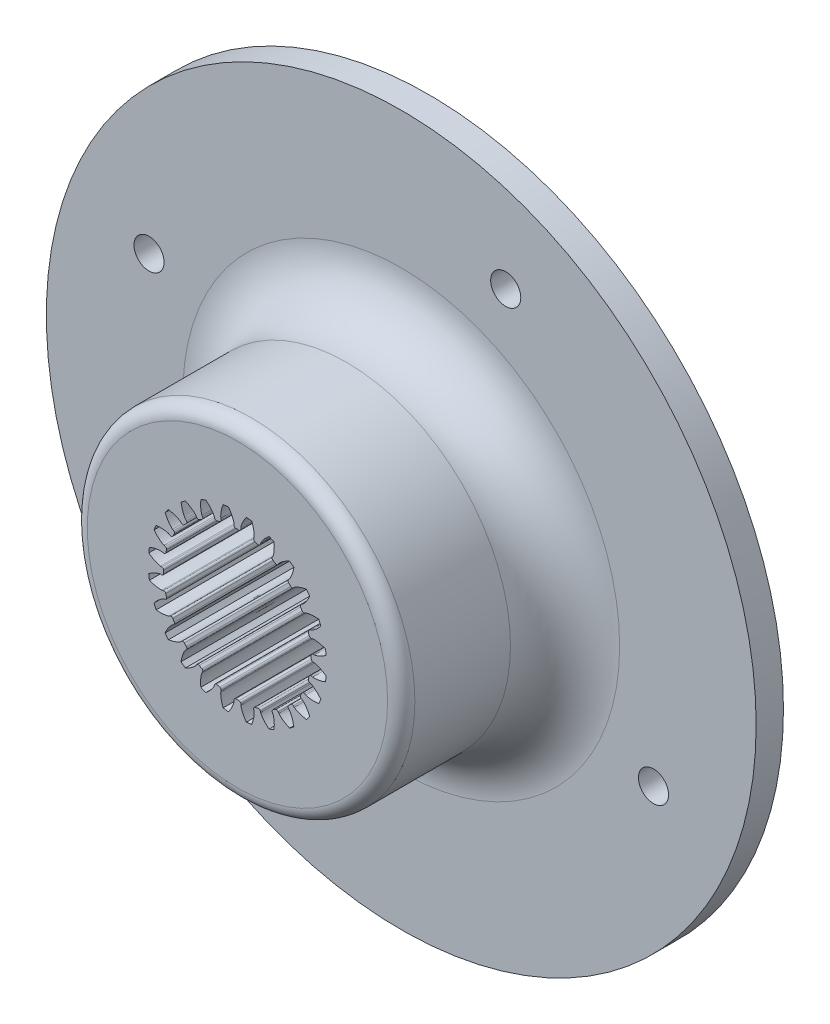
from build123d import *

# Parameters (mm, degrees)
SKETCH1_R           = 82.55
SKETCH1_R_2         = 3.5
SKETCH1_R_3         = 30
BOSS_EXTRUDE1_DEPTH = 6.35
SKETCH2_R           = 38.1
BOSS_EXTRUDE2_DEPTH = 38.1
FILLET1_R           = 12.7
FILLET2_R           = 3.175


with BuildPart() as part:
    # Sketch1 → Boss-Extrude1 (new body)
    # profile 1 of 2: a face of its own
    with BuildSketch(Plane.XY):
        with Locations((300, 306.787824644)):
            Circle(SKETCH1_R)
        with Locations((241.333649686, 331.088222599)):
            Circle(SKETCH1_R_2, mode=Mode.SUBTRACT)
        with Locations((324.300397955, 365.454174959)):
            Circle(SKETCH1_R_2, mode=Mode.SUBTRACT)
        with Locations((358.666350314, 282.487426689)):
            Circle(SKETCH1_R_2, mode=Mode.SUBTRACT)
        with Locations((275.699602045, 248.12147433)):
            Circle(SKETCH1_R_2, mode=Mode.SUBTRACT)
        with Locations((300, 306.787824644)):
            Circle(SKETCH1_R_3, mode=Mode.SUBTRACT)
    # profile 2 of 2: a face of its own
    with BuildSketch(Plane.XY):
        with Locations((300, 306.787824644)):
            Circle(SKETCH1_R_3)
    extrude(amount=BOSS_EXTRUDE1_DEPTH)

    # Sketch2 → Boss-Extrude2 (add)
    with BuildSketch(Plane.XY.offset(6.35)):
        with Locations(Location((300, 306.787824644, 0), (0, 0, 180))):
            Circle(SKETCH2_R)
        with BuildLine():
            Line((284.914350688, 316.426594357), (285.175965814, 316.257373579))
            ThreePointArc((285.175965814, 316.257373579), (285.362581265, 315.991230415), (285.311198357, 315.670267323))
            ThreePointArc((285.311198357, 315.670267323), (285.134132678, 315.370637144), (284.963178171, 315.067478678))
            ThreePointArc((284.963178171, 315.067478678), (284.710907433, 314.862498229), (284.387112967, 314.891040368))
            Line((284.387112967, 314.891040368), (284.109755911, 315.032995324))
            add(Edge.make_bspline(
                [(284.109755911, 315.032995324), (283.877385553, 315.148388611), (283.357209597, 315.262313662), (282.60596157, 315.35436869), (281.840682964, 315.363024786), (281.340658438, 315.326080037), (281.090403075, 315.300817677)],
                knots=[-0.000187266, -0.000187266, -0.000187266, -0.000187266, 0.232040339, 0.464267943, 0.696495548, 0.928723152, 0.928723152, 0.928723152, 0.928723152], degree=3))
            ThreePointArc((281.090403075, 315.300817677), (280.841048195, 314.723722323), (280.609300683, 314.139333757))
            add(Edge.make_bspline(
                [(280.609300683, 314.139333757), (280.768394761, 313.944513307), (281.095841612, 313.564818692), (281.643096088, 313.029805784), (282.239401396, 312.563685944), (282.687778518, 312.276423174), (282.93368455, 312.193707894)],
                knots=[-0.019632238, -0.019632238, -0.019632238, -0.019632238, 0.212595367, 0.444822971, 0.677050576, 0.90927818, 0.90927818, 0.90927818, 0.90927818], degree=3))
            Line((282.93368455, 312.193707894), (283.230182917, 312.097964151))
            ThreePointArc((283.230182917, 312.097964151), (283.47932252, 311.889189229), (283.512761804, 311.565863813))
            ThreePointArc((283.512761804, 311.565863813), (283.419279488, 311.230615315), (283.332613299, 310.893540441))
            ThreePointArc((283.332613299, 310.893540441), (283.141991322, 310.63025206), (282.821842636, 310.574017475))
            Line((282.821842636, 310.574017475), (282.517195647, 310.639350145))
            add(Edge.make_bspline(
                [(282.517195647, 310.639350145), (282.262877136, 310.690669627), (281.730939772, 310.666081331), (280.981464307, 310.560562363), (280.240021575, 310.370854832), (279.766596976, 310.205753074), (279.531407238, 310.116580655)],
                knots=[-0.000187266, -0.000187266, -0.000187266, -0.000187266, 0.232040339, 0.464267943, 0.696495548, 0.928723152, 0.928723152, 0.928723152, 0.928723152], degree=3))
            ThreePointArc((279.531407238, 310.116580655), (279.439912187, 309.494611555), (279.367312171, 308.870154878))
            add(Edge.make_bspline(
                [(279.367312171, 308.870154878), (279.571408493, 308.723149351), (279.985970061, 308.441141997), (280.653048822, 308.065999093), (281.349676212, 307.770097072), (281.85712433, 307.608671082), (282.116059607, 307.592419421)],
                knots=[-0.019632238, -0.019632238, -0.019632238, -0.019632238, 0.212595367, 0.444822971, 0.677050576, 0.90927818, 0.90927818, 0.90927818, 0.90927818], degree=3))
            Line((282.116059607, 307.592419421), (282.427235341, 307.576677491))
            ThreePointArc((282.427235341, 307.576677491), (282.721920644, 307.439498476), (282.837903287, 307.13584483))
            ThreePointArc((282.837903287, 307.13584483), (282.834375, 306.787824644), (282.837903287, 306.439804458))
            ThreePointArc((282.837903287, 306.439804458), (282.721920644, 306.136150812), (282.427235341, 305.998971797))
            Line((282.427235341, 305.998971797), (282.116059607, 305.983229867))
            add(Edge.make_bspline(
                [(282.116059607, 305.983229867), (281.85712433, 305.966978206), (281.349676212, 305.805552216), (280.653048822, 305.509650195), (279.985970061, 305.134507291), (279.571408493, 304.852499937), (279.367312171, 304.705494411)],
                knots=[-0.000187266, -0.000187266, -0.000187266, -0.000187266, 0.232040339, 0.464267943, 0.696495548, 0.928723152, 0.928723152, 0.928723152, 0.928723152], degree=3))
            ThreePointArc((279.367312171, 304.705494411), (279.439912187, 304.081037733), (279.531407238, 303.459068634))
            add(Edge.make_bspline(
                [(279.531407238, 303.459068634), (279.766596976, 303.369896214), (280.240021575, 303.204794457), (280.981464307, 303.015086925), (281.730939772, 302.909567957), (282.262877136, 302.884979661), (282.517195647, 302.936299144)],
                knots=[-0.019632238, -0.019632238, -0.019632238, -0.019632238, 0.212595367, 0.444822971, 0.677050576, 0.90927818, 0.90927818, 0.90927818, 0.90927818], degree=3))
            Line((282.517195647, 302.936299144), (282.821842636, 303.001631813))
            ThreePointArc((282.821842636, 303.001631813), (283.141991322, 302.945397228), (283.332613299, 302.682108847))
            ThreePointArc((283.332613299, 302.682108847), (283.419279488, 302.345033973), (283.512761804, 302.009785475))
            ThreePointArc((283.512761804, 302.009785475), (283.47932252, 301.68646006), (283.230182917, 301.477685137))
            Line((283.230182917, 301.477685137), (282.93368455, 301.381941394))
            add(Edge.make_bspline(
                [(282.93368455, 301.381941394), (282.687778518, 301.299226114), (282.239401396, 301.011963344), (281.643096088, 300.545843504), (281.095841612, 300.010830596), (280.768394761, 299.631135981), (280.609300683, 299.436315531)],
                knots=[-0.000187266, -0.000187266, -0.000187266, -0.000187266, 0.232040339, 0.464267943, 0.696495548, 0.928723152, 0.928723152, 0.928723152, 0.928723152], degree=3))
            ThreePointArc((280.609300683, 299.436315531), (280.841048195, 298.851926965), (281.090403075, 298.274831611))
            add(Edge.make_bspline(
                [(281.090403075, 298.274831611), (281.340658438, 298.249569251), (281.840682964, 298.212624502), (282.60596157, 298.221280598), (283.357209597, 298.313335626), (283.877385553, 298.427260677), (284.109755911, 298.542653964)],
                knots=[-0.019632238, -0.019632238, -0.019632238, -0.019632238, 0.212595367, 0.444822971, 0.677050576, 0.90927818, 0.90927818, 0.90927818, 0.90927818], degree=3))
            Line((284.109755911, 298.542653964), (284.387112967, 298.68460892))
            ThreePointArc((284.387112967, 298.68460892), (284.710907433, 298.713151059), (284.963178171, 298.50817061))
            ThreePointArc((284.963178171, 298.50817061), (285.134132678, 298.205012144), (285.311198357, 297.905381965))
            ThreePointArc((285.311198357, 297.905381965), (285.362581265, 297.584418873), (285.175965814, 297.318275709))
            Line((285.175965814, 297.318275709), (284.914350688, 297.149054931))
            add(Edge.make_bspline(
                [(284.914350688, 297.149054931), (284.698231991, 297.005512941), (284.339482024, 296.611989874), (283.884136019, 296.007417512), (283.494000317, 295.348994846), (283.275983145, 294.89748853), (283.172733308, 294.668129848)],
                knots=[-0.000187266, -0.000187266, -0.000187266, -0.000187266, 0.232040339, 0.464267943, 0.696495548, 0.928723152, 0.928723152, 0.928723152, 0.928723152], degree=3))
            ThreePointArc((283.172733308, 294.668129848), (283.547835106, 294.16363451), (283.938056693, 293.670740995))
            add(Edge.make_bspline(
                [(283.938056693, 293.670740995), (284.186323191, 293.711110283), (284.678871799, 293.804840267), (285.415833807, 294.011270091), (286.117658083, 294.294625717), (286.590623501, 294.53930031), (286.785210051, 294.710903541)],
                knots=[-0.019632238, -0.019632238, -0.019632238, -0.019632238, 0.212595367, 0.444822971, 0.677050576, 0.90927818, 0.90927818, 0.90927818, 0.90927818], degree=3))
            Line((286.785210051, 294.710903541), (287.016375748, 294.919806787))
            ThreePointArc((287.016375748, 294.919806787), (287.321749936, 295.031180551), (287.618477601, 294.898477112))
            ThreePointArc((287.618477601, 294.898477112), (287.862070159, 294.649894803), (288.110652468, 294.406302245))
            ThreePointArc((288.110652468, 294.406302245), (288.243355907, 294.10957458), (288.131982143, 293.804200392))
            Line((288.131982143, 293.804200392), (287.923078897, 293.573034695))
            add(Edge.make_bspline(
                [(287.923078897, 293.573034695), (287.751475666, 293.378448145), (287.506801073, 292.905482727), (287.223445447, 292.203658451), (287.017015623, 291.466696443), (286.923285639, 290.974147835), (286.882916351, 290.725881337)],
                knots=[-0.000187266, -0.000187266, -0.000187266, -0.000187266, 0.232040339, 0.464267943, 0.696495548, 0.928723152, 0.928723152, 0.928723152, 0.928723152], degree=3))
            ThreePointArc((286.882916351, 290.725881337), (287.375809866, 290.33565975), (287.880305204, 289.960557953))
            add(Edge.make_bspline(
                [(287.880305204, 289.960557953), (288.109663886, 290.063807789), (288.561170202, 290.281824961), (289.219592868, 290.671960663), (289.82416523, 291.127306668), (290.217688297, 291.486056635), (290.361230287, 291.702175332)],
                knots=[-0.019632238, -0.019632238, -0.019632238, -0.019632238, 0.212595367, 0.444822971, 0.677050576, 0.90927818, 0.90927818, 0.90927818, 0.90927818], degree=3))
            Line((290.361230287, 291.702175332), (290.530451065, 291.963790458))
            ThreePointArc((290.530451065, 291.963790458), (290.796594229, 292.150405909), (291.117557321, 292.099023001))
            ThreePointArc((291.117557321, 292.099023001), (291.4171875, 291.921957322), (291.720345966, 291.751002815))
            ThreePointArc((291.720345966, 291.751002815), (291.925326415, 291.498732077), (291.896784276, 291.174937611))
            Line((291.896784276, 291.174937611), (291.75482932, 290.897580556))
            add(Edge.make_bspline(
                [(291.75482932, 290.897580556), (291.639436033, 290.665210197), (291.525510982, 290.145034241), (291.433455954, 289.393786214), (291.424799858, 288.628507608), (291.461744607, 288.128483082), (291.487006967, 287.878227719)],
                knots=[-0.000187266, -0.000187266, -0.000187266, -0.000187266, 0.232040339, 0.464267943, 0.696495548, 0.928723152, 0.928723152, 0.928723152, 0.928723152], degree=3))
            ThreePointArc((291.487006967, 287.878227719), (292.064102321, 287.628872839), (292.648490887, 287.397125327))
            add(Edge.make_bspline(
                [(292.648490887, 287.397125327), (292.843311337, 287.556219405), (293.223005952, 287.883666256), (293.75801886, 288.430920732), (294.2241387, 289.02722604), (294.51140147, 289.475603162), (294.59411675, 289.721509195)],
                knots=[-0.019632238, -0.019632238, -0.019632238, -0.019632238, 0.212595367, 0.444822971, 0.677050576, 0.90927818, 0.90927818, 0.90927818, 0.90927818], degree=3))
            Line((294.59411675, 289.721509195), (294.689860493, 290.018007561))
            ThreePointArc((294.689860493, 290.018007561), (294.898635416, 290.267147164), (295.221960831, 290.300586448))
            ThreePointArc((295.221960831, 290.300586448), (295.557209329, 290.207104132), (295.894284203, 290.120437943))
            ThreePointArc((295.894284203, 290.120437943), (296.157572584, 289.929815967), (296.213807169, 289.60966728))
            Line((296.213807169, 289.60966728), (296.148474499, 289.305020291))
            add(Edge.make_bspline(
                [(296.148474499, 289.305020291), (296.097155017, 289.05070178), (296.121743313, 288.518764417), (296.227262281, 287.769288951), (296.416969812, 287.027846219), (296.58207157, 286.55442162), (296.67124399, 286.319231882)],
                knots=[-0.000187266, -0.000187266, -0.000187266, -0.000187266, 0.232040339, 0.464267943, 0.696495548, 0.928723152, 0.928723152, 0.928723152, 0.928723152], degree=3))
            ThreePointArc((296.67124399, 286.319231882), (297.293213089, 286.227736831), (297.917669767, 286.155136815))
            add(Edge.make_bspline(
                [(297.917669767, 286.155136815), (298.064675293, 286.359233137), (298.346682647, 286.773794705), (298.721825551, 287.440873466), (299.017727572, 288.137500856), (299.179153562, 288.644948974), (299.195405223, 288.903884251)],
                knots=[-0.019632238, -0.019632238, -0.019632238, -0.019632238, 0.212595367, 0.444822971, 0.677050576, 0.90927818, 0.90927818, 0.90927818, 0.90927818], degree=3))
            Line((299.195405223, 288.903884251), (299.211147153, 289.215059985))
            ThreePointArc((299.211147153, 289.215059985), (299.348326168, 289.509745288), (299.651979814, 289.625727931))
            ThreePointArc((299.651979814, 289.625727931), (300, 289.622199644), (300.348020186, 289.625727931))
            ThreePointArc((300.348020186, 289.625727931), (300.651673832, 289.509745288), (300.788852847, 289.215059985))
            Line((300.788852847, 289.215059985), (300.804594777, 288.903884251))
            add(Edge.make_bspline(
                [(300.804594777, 288.903884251), (300.820846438, 288.644948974), (300.982272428, 288.137500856), (301.278174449, 287.440873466), (301.653317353, 286.773794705), (301.935324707, 286.359233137), (302.082330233, 286.155136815)],
                knots=[-0.000187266, -0.000187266, -0.000187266, -0.000187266, 0.232040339, 0.464267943, 0.696495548, 0.928723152, 0.928723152, 0.928723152, 0.928723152], degree=3))
            ThreePointArc((302.082330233, 286.155136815), (302.706786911, 286.227736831), (303.32875601, 286.319231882))
            add(Edge.make_bspline(
                [(303.32875601, 286.319231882), (303.41792843, 286.55442162), (303.583030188, 287.027846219), (303.772737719, 287.769288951), (303.878256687, 288.518764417), (303.902844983, 289.05070178), (303.851525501, 289.305020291)],
                knots=[-0.019632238, -0.019632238, -0.019632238, -0.019632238, 0.212595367, 0.444822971, 0.677050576, 0.90927818, 0.90927818, 0.90927818, 0.90927818], degree=3))
            Line((303.851525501, 289.305020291), (303.786192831, 289.60966728))
            ThreePointArc((303.786192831, 289.60966728), (303.842427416, 289.929815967), (304.105715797, 290.120437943))
            ThreePointArc((304.105715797, 290.120437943), (304.442790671, 290.207104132), (304.778039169, 290.300586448))
            ThreePointArc((304.778039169, 290.300586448), (305.101364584, 290.267147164), (305.310139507, 290.018007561))
            Line((305.310139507, 290.018007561), (305.40588325, 289.721509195))
            add(Edge.make_bspline(
                [(305.40588325, 289.721509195), (305.48859853, 289.475603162), (305.7758613, 289.02722604), (306.24198114, 288.430920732), (306.776994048, 287.883666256), (307.156688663, 287.556219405), (307.351509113, 287.397125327)],
                knots=[-0.000187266, -0.000187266, -0.000187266, -0.000187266, 0.232040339, 0.464267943, 0.696495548, 0.928723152, 0.928723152, 0.928723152, 0.928723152], degree=3))
            ThreePointArc((307.351509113, 287.397125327), (307.935897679, 287.628872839), (308.512993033, 287.878227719))
            add(Edge.make_bspline(
                [(308.512993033, 287.878227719), (308.538255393, 288.128483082), (308.575200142, 288.628507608), (308.566544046, 289.393786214), (308.474489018, 290.145034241), (308.360563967, 290.665210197), (308.24517068, 290.897580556)],
                knots=[-0.019632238, -0.019632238, -0.019632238, -0.019632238, 0.212595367, 0.444822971, 0.677050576, 0.90927818, 0.90927818, 0.90927818, 0.90927818], degree=3))
            Line((308.24517068, 290.897580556), (308.103215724, 291.174937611))
            ThreePointArc((308.103215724, 291.174937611), (308.074673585, 291.498732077), (308.279654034, 291.751002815))
            ThreePointArc((308.279654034, 291.751002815), (308.5828125, 291.921957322), (308.882442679, 292.099023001))
            ThreePointArc((308.882442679, 292.099023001), (309.203405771, 292.150405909), (309.469548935, 291.963790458))
            Line((309.469548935, 291.963790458), (309.638769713, 291.702175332))
            add(Edge.make_bspline(
                [(309.638769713, 291.702175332), (309.782311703, 291.486056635), (310.17583477, 291.127306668), (310.780407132, 290.671960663), (311.438829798, 290.281824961), (311.890336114, 290.063807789), (312.119694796, 289.960557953)],
                knots=[-0.000187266, -0.000187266, -0.000187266, -0.000187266, 0.232040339, 0.464267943, 0.696495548, 0.928723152, 0.928723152, 0.928723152, 0.928723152], degree=3))
            ThreePointArc((312.119694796, 289.960557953), (312.624190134, 290.33565975), (313.117083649, 290.725881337))
            add(Edge.make_bspline(
                [(313.117083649, 290.725881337), (313.076714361, 290.974147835), (312.982984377, 291.466696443), (312.776554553, 292.203658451), (312.493198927, 292.905482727), (312.248524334, 293.378448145), (312.076921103, 293.573034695)],
                knots=[-0.019632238, -0.019632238, -0.019632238, -0.019632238, 0.212595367, 0.444822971, 0.677050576, 0.90927818, 0.90927818, 0.90927818, 0.90927818], degree=3))
            Line((312.076921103, 293.573034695), (311.868017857, 293.804200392))
            ThreePointArc((311.868017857, 293.804200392), (311.756644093, 294.10957458), (311.889347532, 294.406302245))
            ThreePointArc((311.889347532, 294.406302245), (312.137929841, 294.649894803), (312.381522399, 294.898477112))
            ThreePointArc((312.381522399, 294.898477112), (312.678250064, 295.031180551), (312.983624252, 294.919806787))
            Line((312.983624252, 294.919806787), (313.214789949, 294.710903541))
            add(Edge.make_bspline(
                [(313.214789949, 294.710903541), (313.409376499, 294.53930031), (313.882341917, 294.294625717), (314.584166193, 294.011270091), (315.321128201, 293.804840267), (315.813676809, 293.711110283), (316.061943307, 293.670740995)],
                knots=[-0.000187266, -0.000187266, -0.000187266, -0.000187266, 0.232040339, 0.464267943, 0.696495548, 0.928723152, 0.928723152, 0.928723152, 0.928723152], degree=3))
            ThreePointArc((316.061943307, 293.670740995), (316.452164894, 294.16363451), (316.827266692, 294.668129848))
            add(Edge.make_bspline(
                [(316.827266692, 294.668129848), (316.724016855, 294.89748853), (316.505999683, 295.348994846), (316.115863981, 296.007417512), (315.660517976, 296.611989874), (315.301768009, 297.005512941), (315.085649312, 297.149054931)],
                knots=[-0.019632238, -0.019632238, -0.019632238, -0.019632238, 0.212595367, 0.444822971, 0.677050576, 0.90927818, 0.90927818, 0.90927818, 0.90927818], degree=3))
            Line((315.085649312, 297.149054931), (314.824034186, 297.318275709))
            ThreePointArc((314.824034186, 297.318275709), (314.637418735, 297.584418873), (314.688801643, 297.905381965))
            ThreePointArc((314.688801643, 297.905381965), (314.865867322, 298.205012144), (315.036821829, 298.50817061))
            ThreePointArc((315.036821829, 298.50817061), (315.289092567, 298.713151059), (315.612887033, 298.68460892))
            Line((315.612887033, 298.68460892), (315.890244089, 298.542653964))
            add(Edge.make_bspline(
                [(315.890244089, 298.542653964), (316.122614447, 298.427260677), (316.642790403, 298.313335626), (317.39403843, 298.221280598), (318.159317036, 298.212624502), (318.659341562, 298.249569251), (318.909596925, 298.274831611)],
                knots=[-0.000187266, -0.000187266, -0.000187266, -0.000187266, 0.232040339, 0.464267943, 0.696495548, 0.928723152, 0.928723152, 0.928723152, 0.928723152], degree=3))
            ThreePointArc((318.909596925, 298.274831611), (319.158951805, 298.851926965), (319.390699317, 299.436315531))
            add(Edge.make_bspline(
                [(319.390699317, 299.436315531), (319.231605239, 299.631135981), (318.904158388, 300.010830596), (318.356903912, 300.545843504), (317.760598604, 301.011963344), (317.312221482, 301.299226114), (317.06631545, 301.381941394)],
                knots=[-0.019632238, -0.019632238, -0.019632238, -0.019632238, 0.212595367, 0.444822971, 0.677050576, 0.90927818, 0.90927818, 0.90927818, 0.90927818], degree=3))
            Line((317.06631545, 301.381941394), (316.769817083, 301.477685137))
            ThreePointArc((316.769817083, 301.477685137), (316.52067748, 301.68646006), (316.487238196, 302.009785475))
            ThreePointArc((316.487238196, 302.009785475), (316.580720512, 302.345033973), (316.667386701, 302.682108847))
            ThreePointArc((316.667386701, 302.682108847), (316.858008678, 302.945397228), (317.178157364, 303.001631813))
            Line((317.178157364, 303.001631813), (317.482804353, 302.936299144))
            add(Edge.make_bspline(
                [(317.482804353, 302.936299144), (317.737122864, 302.884979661), (318.269060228, 302.909567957), (319.018535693, 303.015086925), (319.759978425, 303.204794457), (320.233403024, 303.369896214), (320.468592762, 303.459068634)],
                knots=[-0.000187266, -0.000187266, -0.000187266, -0.000187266, 0.232040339, 0.464267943, 0.696495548, 0.928723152, 0.928723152, 0.928723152, 0.928723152], degree=3))
            ThreePointArc((320.468592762, 303.459068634), (320.560087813, 304.081037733), (320.632687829, 304.705494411))
            add(Edge.make_bspline(
                [(320.632687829, 304.705494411), (320.428591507, 304.852499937), (320.014029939, 305.134507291), (319.346951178, 305.509650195), (318.650323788, 305.805552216), (318.14287567, 305.966978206), (317.883940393, 305.983229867)],
                knots=[-0.019632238, -0.019632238, -0.019632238, -0.019632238, 0.212595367, 0.444822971, 0.677050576, 0.90927818, 0.90927818, 0.90927818, 0.90927818], degree=3))
            Line((317.883940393, 305.983229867), (317.572764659, 305.998971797))
            ThreePointArc((317.572764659, 305.998971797), (317.278079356, 306.136150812), (317.162096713, 306.439804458))
            ThreePointArc((317.162096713, 306.439804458), (317.165625, 306.787824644), (317.162096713, 307.13584483))
            ThreePointArc((317.162096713, 307.13584483), (317.278079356, 307.439498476), (317.572764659, 307.576677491))
            Line((317.572764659, 307.576677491), (317.883940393, 307.592419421))
            add(Edge.make_bspline(
                [(317.883940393, 307.592419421), (318.14287567, 307.608671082), (318.650323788, 307.770097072), (319.346951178, 308.065999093), (320.014029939, 308.441141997), (320.428591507, 308.723149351), (320.632687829, 308.870154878)],
                knots=[-0.000187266, -0.000187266, -0.000187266, -0.000187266, 0.232040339, 0.464267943, 0.696495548, 0.928723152, 0.928723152, 0.928723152, 0.928723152], degree=3))
            ThreePointArc((320.632687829, 308.870154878), (320.560087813, 309.494611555), (320.468592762, 310.116580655))
            add(Edge.make_bspline(
                [(320.468592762, 310.116580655), (320.233403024, 310.205753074), (319.759978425, 310.370854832), (319.018535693, 310.560562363), (318.269060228, 310.666081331), (317.737122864, 310.690669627), (317.482804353, 310.639350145)],
                knots=[-0.019632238, -0.019632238, -0.019632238, -0.019632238, 0.212595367, 0.444822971, 0.677050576, 0.90927818, 0.90927818, 0.90927818, 0.90927818], degree=3))
            Line((317.482804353, 310.639350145), (317.178157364, 310.574017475))
            ThreePointArc((317.178157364, 310.574017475), (316.858008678, 310.63025206), (316.667386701, 310.893540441))
            ThreePointArc((316.667386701, 310.893540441), (316.580720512, 311.230615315), (316.487238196, 311.565863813))
            ThreePointArc((316.487238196, 311.565863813), (316.52067748, 311.889189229), (316.769817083, 312.097964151))
            Line((316.769817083, 312.097964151), (317.06631545, 312.193707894))
            add(Edge.make_bspline(
                [(317.06631545, 312.193707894), (317.312221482, 312.276423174), (317.760598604, 312.563685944), (318.356903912, 313.029805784), (318.904158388, 313.564818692), (319.231605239, 313.944513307), (319.390699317, 314.139333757)],
                knots=[-0.000187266, -0.000187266, -0.000187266, -0.000187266, 0.232040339, 0.464267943, 0.696495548, 0.928723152, 0.928723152, 0.928723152, 0.928723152], degree=3))
            ThreePointArc((319.390699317, 314.139333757), (319.158951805, 314.723722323), (318.909596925, 315.300817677))
            add(Edge.make_bspline(
                [(318.909596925, 315.300817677), (318.659341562, 315.326080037), (318.159317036, 315.363024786), (317.39403843, 315.35436869), (316.642790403, 315.262313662), (316.122614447, 315.148388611), (315.890244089, 315.032995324)],
                knots=[-0.019632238, -0.019632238, -0.019632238, -0.019632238, 0.212595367, 0.444822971, 0.677050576, 0.90927818, 0.90927818, 0.90927818, 0.90927818], degree=3))
            Line((315.890244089, 315.032995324), (315.612887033, 314.891040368))
            ThreePointArc((315.612887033, 314.891040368), (315.289092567, 314.862498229), (315.036821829, 315.067478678))
            ThreePointArc((315.036821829, 315.067478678), (314.865867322, 315.370637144), (314.688801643, 315.670267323))
            ThreePointArc((314.688801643, 315.670267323), (314.637418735, 315.991230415), (314.824034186, 316.257373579))
            Line((314.824034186, 316.257373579), (315.085649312, 316.426594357))
            add(Edge.make_bspline(
                [(315.085649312, 316.426594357), (315.301768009, 316.570136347), (315.660517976, 316.963659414), (316.115863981, 317.568231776), (316.505999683, 318.226654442), (316.724016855, 318.678160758), (316.827266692, 318.90751944)],
                knots=[-0.000187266, -0.000187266, -0.000187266, -0.000187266, 0.232040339, 0.464267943, 0.696495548, 0.928723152, 0.928723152, 0.928723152, 0.928723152], degree=3))
            ThreePointArc((316.827266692, 318.90751944), (316.452164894, 319.412014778), (316.061943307, 319.904908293))
            add(Edge.make_bspline(
                [(316.061943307, 319.904908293), (315.813676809, 319.864539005), (315.321128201, 319.770809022), (314.584166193, 319.564379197), (313.882341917, 319.281023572), (313.409376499, 319.036348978), (313.214789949, 318.864745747)],
                knots=[-0.019632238, -0.019632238, -0.019632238, -0.019632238, 0.212595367, 0.444822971, 0.677050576, 0.90927818, 0.90927818, 0.90927818, 0.90927818], degree=3))
            Line((313.214789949, 318.864745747), (312.983624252, 318.655842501))
            ThreePointArc((312.983624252, 318.655842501), (312.678250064, 318.544468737), (312.381522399, 318.677172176))
            ThreePointArc((312.381522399, 318.677172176), (312.137929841, 318.925754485), (311.889347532, 319.169347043))
            ThreePointArc((311.889347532, 319.169347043), (311.756644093, 319.466074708), (311.868017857, 319.771448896))
            Line((311.868017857, 319.771448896), (312.076921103, 320.002614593))
            add(Edge.make_bspline(
                [(312.076921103, 320.002614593), (312.248524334, 320.197201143), (312.493198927, 320.670166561), (312.776554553, 321.371990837), (312.982984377, 322.108952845), (313.076714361, 322.601501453), (313.117083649, 322.849767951)],
                knots=[-0.000187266, -0.000187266, -0.000187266, -0.000187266, 0.232040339, 0.464267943, 0.696495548, 0.928723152, 0.928723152, 0.928723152, 0.928723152], degree=3))
            ThreePointArc((313.117083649, 322.849767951), (312.624190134, 323.239989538), (312.119694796, 323.615091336))
            add(Edge.make_bspline(
                [(312.119694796, 323.615091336), (311.890336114, 323.5118415), (311.438829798, 323.293824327), (310.780407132, 322.903688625), (310.17583477, 322.44834262), (309.782311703, 322.089592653), (309.638769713, 321.873473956)],
                knots=[-0.019632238, -0.019632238, -0.019632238, -0.019632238, 0.212595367, 0.444822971, 0.677050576, 0.90927818, 0.90927818, 0.90927818, 0.90927818], degree=3))
            Line((309.638769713, 321.873473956), (309.469548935, 321.61185883))
            ThreePointArc((309.469548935, 321.61185883), (309.203405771, 321.425243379), (308.882442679, 321.476626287))
            ThreePointArc((308.882442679, 321.476626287), (308.5828125, 321.653691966), (308.279654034, 321.824646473))
            ThreePointArc((308.279654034, 321.824646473), (308.074673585, 322.076917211), (308.103215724, 322.400711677))
            Line((308.103215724, 322.400711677), (308.24517068, 322.678068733))
            add(Edge.make_bspline(
                [(308.24517068, 322.678068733), (308.360563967, 322.910439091), (308.474489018, 323.430615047), (308.566544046, 324.181863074), (308.575200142, 324.94714168), (308.538255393, 325.447166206), (308.512993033, 325.697421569)],
                knots=[-0.000187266, -0.000187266, -0.000187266, -0.000187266, 0.232040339, 0.464267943, 0.696495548, 0.928723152, 0.928723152, 0.928723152, 0.928723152], degree=3))
            ThreePointArc((308.512993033, 325.697421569), (307.935897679, 325.94677645), (307.351509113, 326.178523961))
            add(Edge.make_bspline(
                [(307.351509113, 326.178523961), (307.156688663, 326.019429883), (306.776994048, 325.691983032), (306.24198114, 325.144728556), (305.7758613, 324.548423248), (305.48859853, 324.100046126), (305.40588325, 323.854140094)],
                knots=[-0.019632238, -0.019632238, -0.019632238, -0.019632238, 0.212595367, 0.444822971, 0.677050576, 0.90927818, 0.90927818, 0.90927818, 0.90927818], degree=3))
            Line((305.40588325, 323.854140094), (305.310139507, 323.557641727))
            ThreePointArc((305.310139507, 323.557641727), (305.101364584, 323.308502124), (304.778039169, 323.27506284))
            ThreePointArc((304.778039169, 323.27506284), (304.442790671, 323.368545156), (304.105715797, 323.455211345))
            ThreePointArc((304.105715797, 323.455211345), (303.842427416, 323.645833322), (303.786192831, 323.965982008))
            Line((303.786192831, 323.965982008), (303.851525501, 324.270628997))
            add(Edge.make_bspline(
                [(303.851525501, 324.270628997), (303.902844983, 324.524947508), (303.878256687, 325.056884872), (303.772737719, 325.806360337), (303.583030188, 326.547803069), (303.41792843, 327.021227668), (303.32875601, 327.256417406)],
                knots=[-0.000187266, -0.000187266, -0.000187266, -0.000187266, 0.232040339, 0.464267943, 0.696495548, 0.928723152, 0.928723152, 0.928723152, 0.928723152], degree=3))
            ThreePointArc((303.32875601, 327.256417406), (302.706786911, 327.347912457), (302.082330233, 327.420512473))
            add(Edge.make_bspline(
                [(302.082330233, 327.420512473), (301.935324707, 327.216416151), (301.653317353, 326.801854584), (301.278174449, 326.134775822), (300.982272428, 325.438148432), (300.820846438, 324.930700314), (300.804594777, 324.671765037)],
                knots=[-0.019632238, -0.019632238, -0.019632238, -0.019632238, 0.212595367, 0.444822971, 0.677050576, 0.90927818, 0.90927818, 0.90927818, 0.90927818], degree=3))
            Line((300.804594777, 324.671765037), (300.788852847, 324.360589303))
            ThreePointArc((300.788852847, 324.360589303), (300.651673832, 324.065904), (300.348020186, 323.949921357))
            ThreePointArc((300.348020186, 323.949921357), (300, 323.953449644), (299.651979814, 323.949921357))
            ThreePointArc((299.651979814, 323.949921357), (299.348326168, 324.065904), (299.211147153, 324.360589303))
            Line((299.211147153, 324.360589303), (299.195405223, 324.671765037))
            add(Edge.make_bspline(
                [(299.195405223, 324.671765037), (299.179153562, 324.930700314), (299.017727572, 325.438148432), (298.721825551, 326.134775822), (298.346682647, 326.801854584), (298.064675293, 327.216416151), (297.917669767, 327.420512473)],
                knots=[-0.000187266, -0.000187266, -0.000187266, -0.000187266, 0.232040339, 0.464267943, 0.696495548, 0.928723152, 0.928723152, 0.928723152, 0.928723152], degree=3))
            ThreePointArc((297.917669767, 327.420512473), (297.293213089, 327.347912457), (296.67124399, 327.256417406))
            add(Edge.make_bspline(
                [(296.67124399, 327.256417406), (296.58207157, 327.021227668), (296.416969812, 326.547803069), (296.227262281, 325.806360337), (296.121743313, 325.056884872), (296.097155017, 324.524947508), (296.148474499, 324.270628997)],
                knots=[-0.019632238, -0.019632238, -0.019632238, -0.019632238, 0.212595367, 0.444822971, 0.677050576, 0.90927818, 0.90927818, 0.90927818, 0.90927818], degree=3))
            Line((296.148474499, 324.270628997), (296.213807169, 323.965982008))
            ThreePointArc((296.213807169, 323.965982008), (296.157572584, 323.645833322), (295.894284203, 323.455211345))
            ThreePointArc((295.894284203, 323.455211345), (295.557209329, 323.368545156), (295.221960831, 323.27506284))
            ThreePointArc((295.221960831, 323.27506284), (294.898635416, 323.308502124), (294.689860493, 323.557641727))
            Line((294.689860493, 323.557641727), (294.59411675, 323.854140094))
            add(Edge.make_bspline(
                [(294.59411675, 323.854140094), (294.51140147, 324.100046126), (294.2241387, 324.548423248), (293.75801886, 325.144728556), (293.223005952, 325.691983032), (292.843311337, 326.019429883), (292.648490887, 326.178523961)],
                knots=[-0.000187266, -0.000187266, -0.000187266, -0.000187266, 0.232040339, 0.464267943, 0.696495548, 0.928723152, 0.928723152, 0.928723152, 0.928723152], degree=3))
            ThreePointArc((292.648490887, 326.178523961), (292.064102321, 325.94677645), (291.487006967, 325.697421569))
            add(Edge.make_bspline(
                [(291.487006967, 325.697421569), (291.461744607, 325.447166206), (291.424799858, 324.94714168), (291.433455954, 324.181863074), (291.525510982, 323.430615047), (291.639436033, 322.910439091), (291.75482932, 322.678068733)],
                knots=[-0.019632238, -0.019632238, -0.019632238, -0.019632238, 0.212595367, 0.444822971, 0.677050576, 0.90927818, 0.90927818, 0.90927818, 0.90927818], degree=3))
            Line((291.75482932, 322.678068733), (291.896784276, 322.400711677))
            ThreePointArc((291.896784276, 322.400711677), (291.925326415, 322.076917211), (291.720345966, 321.824646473))
            ThreePointArc((291.720345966, 321.824646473), (291.4171875, 321.653691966), (291.117557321, 321.476626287))
            ThreePointArc((291.117557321, 321.476626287), (290.796594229, 321.425243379), (290.530451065, 321.61185883))
            Line((290.530451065, 321.61185883), (290.361230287, 321.873473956))
            add(Edge.make_bspline(
                [(290.361230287, 321.873473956), (290.217688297, 322.089592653), (289.82416523, 322.44834262), (289.219592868, 322.903688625), (288.561170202, 323.293824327), (288.109663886, 323.5118415), (287.880305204, 323.615091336)],
                knots=[-0.000187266, -0.000187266, -0.000187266, -0.000187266, 0.232040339, 0.464267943, 0.696495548, 0.928723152, 0.928723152, 0.928723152, 0.928723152], degree=3))
            ThreePointArc((287.880305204, 323.615091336), (287.375809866, 323.239989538), (286.882916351, 322.849767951))
            add(Edge.make_bspline(
                [(286.882916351, 322.849767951), (286.923285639, 322.601501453), (287.017015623, 322.108952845), (287.223445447, 321.371990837), (287.506801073, 320.670166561), (287.751475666, 320.197201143), (287.923078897, 320.002614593)],
                knots=[-0.019632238, -0.019632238, -0.019632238, -0.019632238, 0.212595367, 0.444822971, 0.677050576, 0.90927818, 0.90927818, 0.90927818, 0.90927818], degree=3))
            Line((287.923078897, 320.002614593), (288.131982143, 319.771448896))
            ThreePointArc((288.131982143, 319.771448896), (288.243355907, 319.466074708), (288.110652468, 319.169347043))
            ThreePointArc((288.110652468, 319.169347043), (287.862070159, 318.925754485), (287.618477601, 318.677172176))
            ThreePointArc((287.618477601, 318.677172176), (287.321749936, 318.544468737), (287.016375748, 318.655842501))
            Line((287.016375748, 318.655842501), (286.785210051, 318.864745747))
            add(Edge.make_bspline(
                [(286.785210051, 318.864745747), (286.590623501, 319.036348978), (286.117658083, 319.281023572), (285.415833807, 319.564379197), (284.678871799, 319.770809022), (284.186323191, 319.864539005), (283.938056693, 319.904908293)],
                knots=[-0.000187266, -0.000187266, -0.000187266, -0.000187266, 0.232040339, 0.464267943, 0.696495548, 0.928723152, 0.928723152, 0.928723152, 0.928723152], degree=3))
            ThreePointArc((283.938056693, 319.904908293), (283.547835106, 319.412014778), (283.172733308, 318.90751944))
            add(Edge.make_bspline(
                [(283.172733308, 318.90751944), (283.275983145, 318.678160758), (283.494000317, 318.226654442), (283.884136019, 317.568231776), (284.339482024, 316.963659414), (284.698231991, 316.570136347), (284.914350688, 316.426594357)],
                knots=[-0.019632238, -0.019632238, -0.019632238, -0.019632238, 0.212595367, 0.444822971, 0.677050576, 0.90927818, 0.90927818, 0.90927818, 0.90927818], degree=3))
        make_face(mode=Mode.SUBTRACT)
    extrude(amount=BOSS_EXTRUDE2_DEPTH)

    # Fillet1
    fillet1_edges = [part.edges().sort_by_distance(p)[0] for p in [
        (338.1, 306.787824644, 6.35),
    ]]
    fillet(fillet1_edges, radius=FILLET1_R)

    # Fillet2
    fillet2_edges = [part.edges().sort_by_distance(p)[0] for p in [
        (338.1, 306.787824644, 44.45),
    ]]
    fillet(fillet2_edges, radius=FILLET2_R)


solid = part.part
